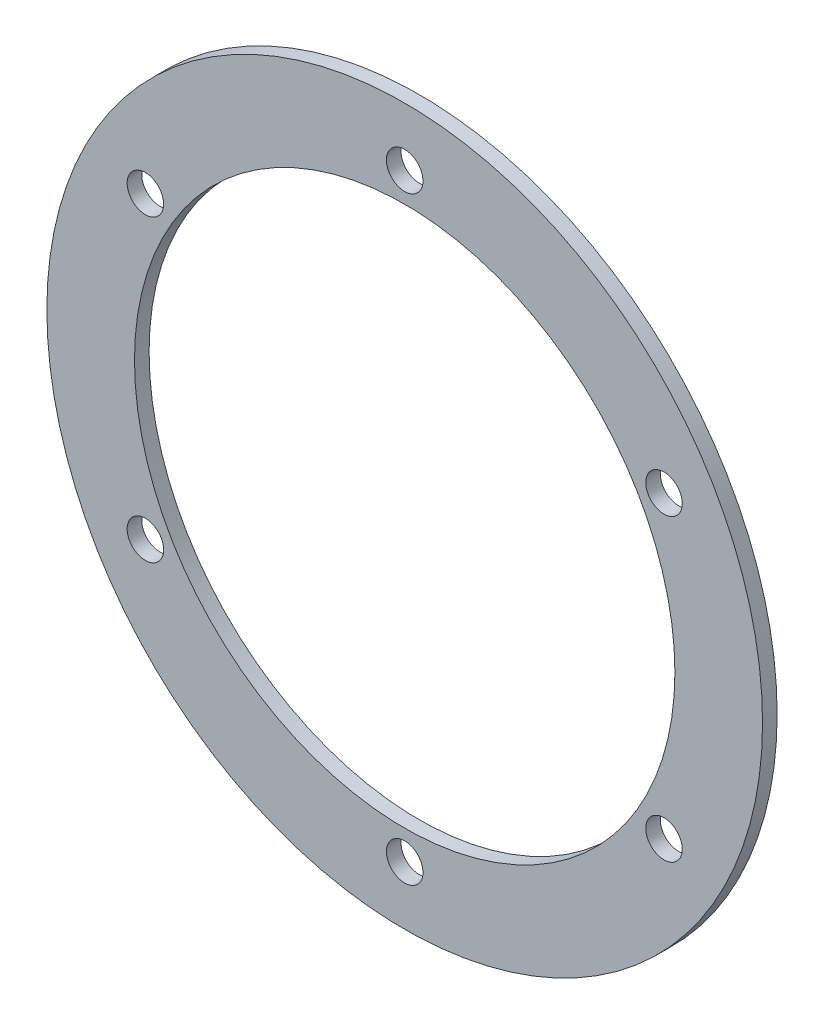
ISO-10303-21;
HEADER;
FILE_DESCRIPTION(('STEP AP214'),'2;1');
FILE_NAME('part.step','',(''),(''),'','','');
FILE_SCHEMA(('AUTOMOTIVE_DESIGN { 1 0 10303 214 1 1 1 1 }'));
ENDSEC;
DATA;
#1=APPLICATION_CONTEXT('core data for automotive mechanical design processes');
#2=APPLICATION_PROTOCOL_DEFINITION('international standard','automotive_design',2000,#1);
#3=PRODUCT_CONTEXT('',#1,'mechanical');
#4=PRODUCT('Part','Part','',(#3));
#5=PRODUCT_RELATED_PRODUCT_CATEGORY('part','',(#4));
#6=PRODUCT_DEFINITION_FORMATION('','',#4);
#7=PRODUCT_DEFINITION_CONTEXT('part definition',#1,'design');
#8=PRODUCT_DEFINITION('design','',#6,#7);
#9=PRODUCT_DEFINITION_SHAPE('','',#8);
#10=(LENGTH_UNIT() NAMED_UNIT(*) SI_UNIT(.MILLI.,.METRE.));
#11=(NAMED_UNIT(*) PLANE_ANGLE_UNIT() SI_UNIT($,.RADIAN.));
#12=(NAMED_UNIT(*) SI_UNIT($,.STERADIAN.) SOLID_ANGLE_UNIT());
#13=UNCERTAINTY_MEASURE_WITH_UNIT(LENGTH_MEASURE(1.E-05),#10,'distance_accuracy_value','');
#14=(GEOMETRIC_REPRESENTATION_CONTEXT(3) GLOBAL_UNCERTAINTY_ASSIGNED_CONTEXT((#13)) GLOBAL_UNIT_ASSIGNED_CONTEXT((#10,
#11,#12)) REPRESENTATION_CONTEXT('',''));
#15=CARTESIAN_POINT('',(0.,0.,0.));
#16=DIRECTION('',(0.,0.,1.));
#17=DIRECTION('',(1.,0.,0.));
#18=AXIS2_PLACEMENT_3D('',#15,#16,#17);
#19=CARTESIAN_POINT('',(0.,0.,0.));
#20=DIRECTION('',(0.,0.,1.));
#21=DIRECTION('',(1.,0.,0.));
#22=AXIS2_PLACEMENT_3D('',#19,#20,#21);
#23=PLANE('',#22);
#24=CARTESIAN_POINT('',(0.,0.,0.));
#25=DIRECTION('',(0.,0.,1.));
#26=DIRECTION('',(1.,0.,0.));
#27=AXIS2_PLACEMENT_3D('',#24,#25,#26);
#28=CIRCLE('',#27,18.5);
#29=CARTESIAN_POINT('',(18.5,0.,0.));
#30=VERTEX_POINT('',#29);
#31=EDGE_CURVE('E32',#30,#30,#28,.T.);
#32=ORIENTED_EDGE('',*,*,#31,.T.);
#33=EDGE_LOOP('',(#32));
#34=FACE_BOUND('',#33,.T.);
#35=CARTESIAN_POINT('',(17.753520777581,10.25,0.));
#36=DIRECTION('',(0.,0.,1.));
#37=DIRECTION('',(1.,0.,0.));
#38=AXIS2_PLACEMENT_3D('',#35,#36,#37);
#39=CIRCLE('',#38,1.25);
#40=CARTESIAN_POINT('',(19.003520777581,10.25,0.));
#41=VERTEX_POINT('',#40);
#42=EDGE_CURVE('E49',#41,#41,#39,.T.);
#43=ORIENTED_EDGE('',*,*,#42,.T.);
#44=EDGE_LOOP('',(#43));
#45=FACE_BOUND('',#44,.T.);
#46=CARTESIAN_POINT('',(-17.7535207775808,10.2500000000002,0.));
#47=DIRECTION('',(0.,0.,1.));
#48=DIRECTION('',(1.,0.,0.));
#49=AXIS2_PLACEMENT_3D('',#46,#47,#48);
#50=CIRCLE('',#49,1.25);
#51=CARTESIAN_POINT('',(-16.5035207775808,10.2500000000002,0.));
#52=VERTEX_POINT('',#51);
#53=EDGE_CURVE('E57',#52,#52,#50,.T.);
#54=ORIENTED_EDGE('',*,*,#53,.T.);
#55=EDGE_LOOP('',(#54));
#56=FACE_BOUND('',#55,.T.);
#57=CARTESIAN_POINT('',(-17.7535207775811,-10.2499999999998,0.));
#58=DIRECTION('',(0.,0.,1.));
#59=DIRECTION('',(1.,0.,0.));
#60=AXIS2_PLACEMENT_3D('',#57,#58,#59);
#61=CIRCLE('',#60,1.25);
#62=CARTESIAN_POINT('',(-16.5035207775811,-10.2499999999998,0.));
#63=VERTEX_POINT('',#62);
#64=EDGE_CURVE('E66',#63,#63,#61,.T.);
#65=ORIENTED_EDGE('',*,*,#64,.T.);
#66=EDGE_LOOP('',(#65));
#67=FACE_BOUND('',#66,.T.);
#68=CARTESIAN_POINT('',(-1.43150734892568E-13,-20.5,0.));
#69=DIRECTION('',(0.,0.,1.));
#70=DIRECTION('',(1.,0.,0.));
#71=AXIS2_PLACEMENT_3D('',#68,#69,#70);
#72=CIRCLE('',#71,1.25);
#73=CARTESIAN_POINT('',(1.24999999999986,-20.5,0.));
#74=VERTEX_POINT('',#73);
#75=EDGE_CURVE('E67',#74,#74,#72,.T.);
#76=ORIENTED_EDGE('',*,*,#75,.T.);
#77=EDGE_LOOP('',(#76));
#78=FACE_BOUND('',#77,.T.);
#79=CARTESIAN_POINT('',(17.7535207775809,-10.25,0.));
#80=DIRECTION('',(0.,0.,1.));
#81=DIRECTION('',(1.,0.,0.));
#82=AXIS2_PLACEMENT_3D('',#79,#80,#81);
#83=CIRCLE('',#82,1.25);
#84=CARTESIAN_POINT('',(19.0035207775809,-10.25,0.));
#85=VERTEX_POINT('',#84);
#86=EDGE_CURVE('E75',#85,#85,#83,.T.);
#87=ORIENTED_EDGE('',*,*,#86,.T.);
#88=EDGE_LOOP('',(#87));
#89=FACE_BOUND('',#88,.T.);
#90=CARTESIAN_POINT('',(0.,20.5,0.));
#91=DIRECTION('',(0.,0.,1.));
#92=DIRECTION('',(1.,0.,0.));
#93=AXIS2_PLACEMENT_3D('',#90,#91,#92);
#94=CIRCLE('',#93,1.25);
#95=CARTESIAN_POINT('',(1.25,20.5,0.));
#96=VERTEX_POINT('',#95);
#97=EDGE_CURVE('E89',#96,#96,#94,.T.);
#98=ORIENTED_EDGE('',*,*,#97,.T.);
#99=EDGE_LOOP('',(#98));
#100=FACE_BOUND('',#99,.T.);
#101=CARTESIAN_POINT('',(0.,0.,0.));
#102=DIRECTION('',(0.,0.,1.));
#103=DIRECTION('',(1.,0.,0.));
#104=AXIS2_PLACEMENT_3D('',#101,#102,#103);
#105=CIRCLE('',#104,24.5);
#106=CARTESIAN_POINT('',(24.5,0.,0.));
#107=VERTEX_POINT('',#106);
#108=EDGE_CURVE('E10',#107,#107,#105,.T.);
#109=ORIENTED_EDGE('',*,*,#108,.F.);
#110=EDGE_LOOP('',(#109));
#111=FACE_BOUND('',#110,.T.);
#112=ADVANCED_FACE('F15',(#34,#45,#56,#67,#78,#89,#100,#111),#23,.F.);
#113=CARTESIAN_POINT('',(0.,0.,1.));
#114=DIRECTION('',(0.,0.,1.));
#115=DIRECTION('',(1.,0.,0.));
#116=AXIS2_PLACEMENT_3D('',#113,#114,#115);
#117=PLANE('',#116);
#118=CARTESIAN_POINT('',(0.,0.,1.));
#119=DIRECTION('',(0.,0.,1.));
#120=DIRECTION('',(1.,0.,0.));
#121=AXIS2_PLACEMENT_3D('',#118,#119,#120);
#122=CIRCLE('',#121,18.5);
#123=CARTESIAN_POINT('',(18.5,0.,1.));
#124=VERTEX_POINT('',#123);
#125=EDGE_CURVE('E39',#124,#124,#122,.T.);
#126=ORIENTED_EDGE('',*,*,#125,.F.);
#127=EDGE_LOOP('',(#126));
#128=FACE_BOUND('',#127,.T.);
#129=CARTESIAN_POINT('',(17.753520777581,10.25,1.));
#130=DIRECTION('',(0.,0.,1.));
#131=DIRECTION('',(1.,0.,0.));
#132=AXIS2_PLACEMENT_3D('',#129,#130,#131);
#133=CIRCLE('',#132,1.25);
#134=CARTESIAN_POINT('',(19.003520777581,10.25,1.));
#135=VERTEX_POINT('',#134);
#136=EDGE_CURVE('E45',#135,#135,#133,.T.);
#137=ORIENTED_EDGE('',*,*,#136,.F.);
#138=EDGE_LOOP('',(#137));
#139=FACE_BOUND('',#138,.T.);
#140=CARTESIAN_POINT('',(-17.7535207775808,10.2500000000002,1.));
#141=DIRECTION('',(0.,0.,1.));
#142=DIRECTION('',(1.,0.,0.));
#143=AXIS2_PLACEMENT_3D('',#140,#141,#142);
#144=CIRCLE('',#143,1.25);
#145=CARTESIAN_POINT('',(-16.5035207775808,10.2500000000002,1.));
#146=VERTEX_POINT('',#145);
#147=EDGE_CURVE('E53',#146,#146,#144,.T.);
#148=ORIENTED_EDGE('',*,*,#147,.F.);
#149=EDGE_LOOP('',(#148));
#150=FACE_BOUND('',#149,.T.);
#151=CARTESIAN_POINT('',(-17.7535207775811,-10.2499999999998,1.));
#152=DIRECTION('',(0.,0.,1.));
#153=DIRECTION('',(1.,0.,0.));
#154=AXIS2_PLACEMENT_3D('',#151,#152,#153);
#155=CIRCLE('',#154,1.25);
#156=CARTESIAN_POINT('',(-16.5035207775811,-10.2499999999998,1.));
#157=VERTEX_POINT('',#156);
#158=EDGE_CURVE('E61',#157,#157,#155,.T.);
#159=ORIENTED_EDGE('',*,*,#158,.F.);
#160=EDGE_LOOP('',(#159));
#161=FACE_BOUND('',#160,.T.);
#162=CARTESIAN_POINT('',(-1.43150734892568E-13,-20.5,1.));
#163=DIRECTION('',(0.,0.,1.));
#164=DIRECTION('',(1.,0.,0.));
#165=AXIS2_PLACEMENT_3D('',#162,#163,#164);
#166=CIRCLE('',#165,1.25);
#167=CARTESIAN_POINT('',(1.24999999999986,-20.5,1.));
#168=VERTEX_POINT('',#167);
#169=EDGE_CURVE('E62',#168,#168,#166,.T.);
#170=ORIENTED_EDGE('',*,*,#169,.F.);
#171=EDGE_LOOP('',(#170));
#172=FACE_BOUND('',#171,.T.);
#173=CARTESIAN_POINT('',(17.7535207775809,-10.25,1.));
#174=DIRECTION('',(0.,0.,1.));
#175=DIRECTION('',(1.,0.,0.));
#176=AXIS2_PLACEMENT_3D('',#173,#174,#175);
#177=CIRCLE('',#176,1.25);
#178=CARTESIAN_POINT('',(19.0035207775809,-10.25,1.));
#179=VERTEX_POINT('',#178);
#180=EDGE_CURVE('E71',#179,#179,#177,.T.);
#181=ORIENTED_EDGE('',*,*,#180,.F.);
#182=EDGE_LOOP('',(#181));
#183=FACE_BOUND('',#182,.T.);
#184=CARTESIAN_POINT('',(0.,20.5,1.));
#185=DIRECTION('',(0.,0.,1.));
#186=DIRECTION('',(1.,0.,0.));
#187=AXIS2_PLACEMENT_3D('',#184,#185,#186);
#188=CIRCLE('',#187,1.25);
#189=CARTESIAN_POINT('',(1.25,20.5,1.));
#190=VERTEX_POINT('',#189);
#191=EDGE_CURVE('E85',#190,#190,#188,.T.);
#192=ORIENTED_EDGE('',*,*,#191,.F.);
#193=EDGE_LOOP('',(#192));
#194=FACE_BOUND('',#193,.T.);
#195=CARTESIAN_POINT('',(0.,0.,1.));
#196=DIRECTION('',(0.,0.,1.));
#197=DIRECTION('',(1.,0.,0.));
#198=AXIS2_PLACEMENT_3D('',#195,#196,#197);
#199=CIRCLE('',#198,24.5);
#200=CARTESIAN_POINT('',(24.5,0.,1.));
#201=VERTEX_POINT('',#200);
#202=EDGE_CURVE('E23',#201,#201,#199,.T.);
#203=ORIENTED_EDGE('',*,*,#202,.T.);
#204=EDGE_LOOP('',(#203));
#205=FACE_BOUND('',#204,.T.);
#206=ADVANCED_FACE('F17',(#128,#139,#150,#161,#172,#183,#194,#205),#117,.T.);
#207=CARTESIAN_POINT('',(0.,0.,1.));
#208=DIRECTION('',(0.,0.,-1.));
#209=DIRECTION('',(-1.,0.,0.));
#210=AXIS2_PLACEMENT_3D('',#207,#208,#209);
#211=CYLINDRICAL_SURFACE('',#210,24.5);
#212=ORIENTED_EDGE('',*,*,#108,.T.);
#213=EDGE_LOOP('',(#212));
#214=FACE_BOUND('',#213,.T.);
#215=ORIENTED_EDGE('',*,*,#202,.F.);
#216=EDGE_LOOP('',(#215));
#217=FACE_BOUND('',#216,.T.);
#218=ADVANCED_FACE('F117',(#214,#217),#211,.T.);
#219=CARTESIAN_POINT('',(0.,0.,1.));
#220=DIRECTION('',(0.,0.,-1.));
#221=DIRECTION('',(-1.,0.,0.));
#222=AXIS2_PLACEMENT_3D('',#219,#220,#221);
#223=CYLINDRICAL_SURFACE('',#222,18.5);
#224=ORIENTED_EDGE('',*,*,#31,.F.);
#225=EDGE_LOOP('',(#224));
#226=FACE_BOUND('',#225,.T.);
#227=ORIENTED_EDGE('',*,*,#125,.T.);
#228=EDGE_LOOP('',(#227));
#229=FACE_BOUND('',#228,.T.);
#230=ADVANCED_FACE('F126',(#226,#229),#223,.F.);
#231=CARTESIAN_POINT('',(17.753520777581,10.25,0.));
#232=DIRECTION('',(0.,0.,1.));
#233=DIRECTION('',(1.,0.,0.));
#234=AXIS2_PLACEMENT_3D('',#231,#232,#233);
#235=CYLINDRICAL_SURFACE('',#234,1.25);
#236=ORIENTED_EDGE('',*,*,#136,.T.);
#237=EDGE_LOOP('',(#236));
#238=FACE_BOUND('',#237,.T.);
#239=ORIENTED_EDGE('',*,*,#42,.F.);
#240=EDGE_LOOP('',(#239));
#241=FACE_BOUND('',#240,.T.);
#242=ADVANCED_FACE('F123',(#238,#241),#235,.F.);
#243=CARTESIAN_POINT('',(-17.7535207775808,10.2500000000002,0.));
#244=DIRECTION('',(0.,0.,1.));
#245=DIRECTION('',(1.,0.,0.));
#246=AXIS2_PLACEMENT_3D('',#243,#244,#245);
#247=CYLINDRICAL_SURFACE('',#246,1.25);
#248=ORIENTED_EDGE('',*,*,#147,.T.);
#249=EDGE_LOOP('',(#248));
#250=FACE_BOUND('',#249,.T.);
#251=ORIENTED_EDGE('',*,*,#53,.F.);
#252=EDGE_LOOP('',(#251));
#253=FACE_BOUND('',#252,.T.);
#254=ADVANCED_FACE('F125',(#250,#253),#247,.F.);
#255=CARTESIAN_POINT('',(-17.7535207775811,-10.2499999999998,0.));
#256=DIRECTION('',(0.,0.,1.));
#257=DIRECTION('',(1.,0.,0.));
#258=AXIS2_PLACEMENT_3D('',#255,#256,#257);
#259=CYLINDRICAL_SURFACE('',#258,1.25);
#260=ORIENTED_EDGE('',*,*,#158,.T.);
#261=EDGE_LOOP('',(#260));
#262=FACE_BOUND('',#261,.T.);
#263=ORIENTED_EDGE('',*,*,#64,.F.);
#264=EDGE_LOOP('',(#263));
#265=FACE_BOUND('',#264,.T.);
#266=ADVANCED_FACE('F121',(#262,#265),#259,.F.);
#267=CARTESIAN_POINT('',(-1.43150734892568E-13,-20.5,0.));
#268=DIRECTION('',(0.,0.,1.));
#269=DIRECTION('',(1.,0.,0.));
#270=AXIS2_PLACEMENT_3D('',#267,#268,#269);
#271=CYLINDRICAL_SURFACE('',#270,1.25);
#272=ORIENTED_EDGE('',*,*,#169,.T.);
#273=EDGE_LOOP('',(#272));
#274=FACE_BOUND('',#273,.T.);
#275=ORIENTED_EDGE('',*,*,#75,.F.);
#276=EDGE_LOOP('',(#275));
#277=FACE_BOUND('',#276,.T.);
#278=ADVANCED_FACE('F107',(#274,#277),#271,.F.);
#279=CARTESIAN_POINT('',(17.7535207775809,-10.25,0.));
#280=DIRECTION('',(0.,0.,1.));
#281=DIRECTION('',(1.,0.,0.));
#282=AXIS2_PLACEMENT_3D('',#279,#280,#281);
#283=CYLINDRICAL_SURFACE('',#282,1.25);
#284=ORIENTED_EDGE('',*,*,#180,.T.);
#285=EDGE_LOOP('',(#284));
#286=FACE_BOUND('',#285,.T.);
#287=ORIENTED_EDGE('',*,*,#86,.F.);
#288=EDGE_LOOP('',(#287));
#289=FACE_BOUND('',#288,.T.);
#290=ADVANCED_FACE('F100',(#286,#289),#283,.F.);
#291=CARTESIAN_POINT('',(0.,20.5,0.));
#292=DIRECTION('',(0.,0.,1.));
#293=DIRECTION('',(1.,0.,0.));
#294=AXIS2_PLACEMENT_3D('',#291,#292,#293);
#295=CYLINDRICAL_SURFACE('',#294,1.25);
#296=ORIENTED_EDGE('',*,*,#191,.T.);
#297=EDGE_LOOP('',(#296));
#298=FACE_BOUND('',#297,.T.);
#299=ORIENTED_EDGE('',*,*,#97,.F.);
#300=EDGE_LOOP('',(#299));
#301=FACE_BOUND('',#300,.T.);
#302=ADVANCED_FACE('F98',(#298,#301),#295,.F.);
#303=CLOSED_SHELL('',(#112,#206,#218,#230,#242,#254,#266,#278,#290,#302));
#304=MANIFOLD_SOLID_BREP('B1',#303);
#305=ADVANCED_BREP_SHAPE_REPRESENTATION('',(#18,#304),#14);
#306=SHAPE_DEFINITION_REPRESENTATION(#9,#305);
ENDSEC;
END-ISO-10303-21;
